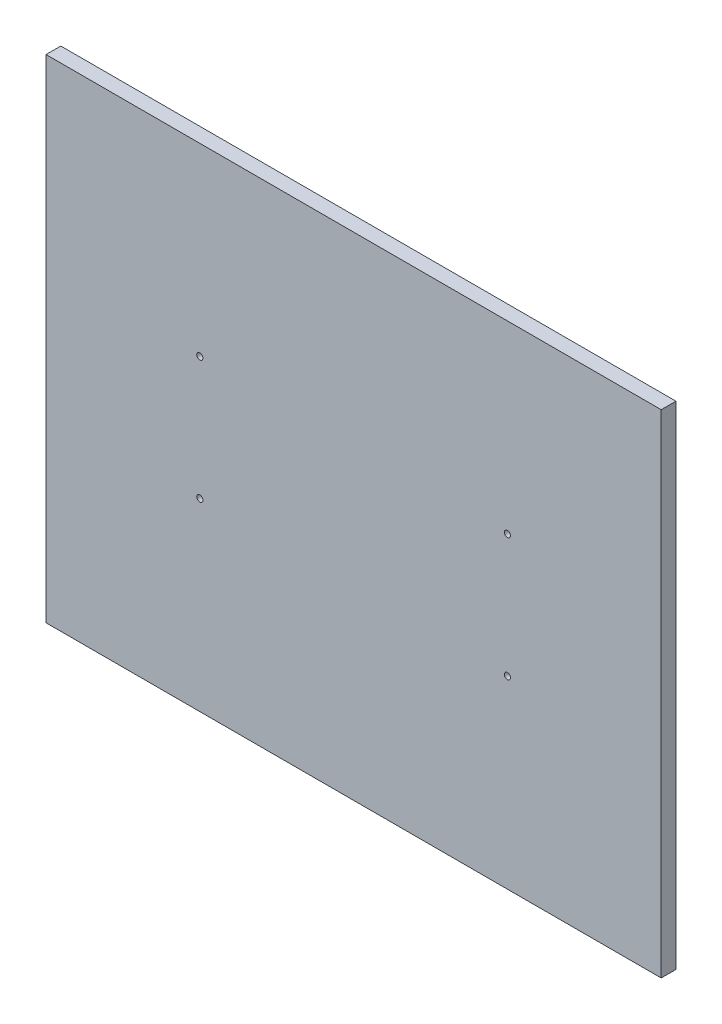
ISO-10303-21;
HEADER;
FILE_DESCRIPTION(('STEP AP214'),'2;1');
FILE_NAME('part.step','',(''),(''),'','','');
FILE_SCHEMA(('AUTOMOTIVE_DESIGN { 1 0 10303 214 1 1 1 1 }'));
ENDSEC;
DATA;
#1=APPLICATION_CONTEXT('core data for automotive mechanical design processes');
#2=APPLICATION_PROTOCOL_DEFINITION('international standard','automotive_design',2000,#1);
#3=PRODUCT_CONTEXT('',#1,'mechanical');
#4=PRODUCT('Part','Part','',(#3));
#5=PRODUCT_RELATED_PRODUCT_CATEGORY('part','',(#4));
#6=PRODUCT_DEFINITION_FORMATION('','',#4);
#7=PRODUCT_DEFINITION_CONTEXT('part definition',#1,'design');
#8=PRODUCT_DEFINITION('design','',#6,#7);
#9=PRODUCT_DEFINITION_SHAPE('','',#8);
#10=(LENGTH_UNIT() NAMED_UNIT(*) SI_UNIT(.MILLI.,.METRE.));
#11=(NAMED_UNIT(*) PLANE_ANGLE_UNIT() SI_UNIT($,.RADIAN.));
#12=(NAMED_UNIT(*) SI_UNIT($,.STERADIAN.) SOLID_ANGLE_UNIT());
#13=UNCERTAINTY_MEASURE_WITH_UNIT(LENGTH_MEASURE(1.E-05),#10,'distance_accuracy_value','');
#14=(GEOMETRIC_REPRESENTATION_CONTEXT(3) GLOBAL_UNCERTAINTY_ASSIGNED_CONTEXT((#13)) GLOBAL_UNIT_ASSIGNED_CONTEXT((#10,
#11,#12)) REPRESENTATION_CONTEXT('',''));
#15=CARTESIAN_POINT('',(0.,0.,0.));
#16=DIRECTION('',(0.,0.,1.));
#17=DIRECTION('',(1.,0.,0.));
#18=AXIS2_PLACEMENT_3D('',#15,#16,#17);
#19=CARTESIAN_POINT('',(0.,0.,6.));
#20=DIRECTION('',(0.,0.,-1.));
#21=DIRECTION('',(-1.,0.,0.));
#22=AXIS2_PLACEMENT_3D('',#19,#20,#21);
#23=PLANE('',#22);
#24=CARTESIAN_POINT('',(-62.5,-25.,6.));
#25=DIRECTION('',(0.,0.,1.));
#26=DIRECTION('',(-1.,0.,0.));
#27=AXIS2_PLACEMENT_3D('',#24,#25,#26);
#28=CIRCLE('',#27,1.25);
#29=CARTESIAN_POINT('',(-63.75,-25.,6.));
#30=VERTEX_POINT('',#29);
#31=EDGE_CURVE('E149',#30,#30,#28,.T.);
#32=ORIENTED_EDGE('',*,*,#31,.F.);
#33=EDGE_LOOP('',(#32));
#34=FACE_BOUND('',#33,.T.);
#35=CARTESIAN_POINT('',(-62.5,25.,6.));
#36=DIRECTION('',(0.,0.,-1.));
#37=DIRECTION('',(-1.,0.,0.));
#38=AXIS2_PLACEMENT_3D('',#35,#36,#37);
#39=CIRCLE('',#38,1.25);
#40=CARTESIAN_POINT('',(-63.75,25.,6.));
#41=VERTEX_POINT('',#40);
#42=EDGE_CURVE('E103',#41,#41,#39,.T.);
#43=ORIENTED_EDGE('',*,*,#42,.T.);
#44=EDGE_LOOP('',(#43));
#45=FACE_BOUND('',#44,.T.);
#46=DIRECTION('',(0.,1.,0.));
#47=VECTOR('',#46,1.);
#48=CARTESIAN_POINT('',(-125.,-100.,6.));
#49=LINE('',#48,#47);
#50=CARTESIAN_POINT('',(-125.,-100.,6.));
#51=VERTEX_POINT('',#50);
#52=CARTESIAN_POINT('',(-125.,100.,6.));
#53=VERTEX_POINT('',#52);
#54=EDGE_CURVE('E93',#51,#53,#49,.T.);
#55=ORIENTED_EDGE('',*,*,#54,.F.);
#56=DIRECTION('',(1.,0.,0.));
#57=VECTOR('',#56,1.);
#58=CARTESIAN_POINT('',(-125.,-100.,6.));
#59=LINE('',#58,#57);
#60=CARTESIAN_POINT('',(125.,-100.,6.));
#61=VERTEX_POINT('',#60);
#62=EDGE_CURVE('E83',#51,#61,#59,.T.);
#63=ORIENTED_EDGE('',*,*,#62,.T.);
#64=DIRECTION('',(0.,1.,0.));
#65=VECTOR('',#64,1.);
#66=CARTESIAN_POINT('',(125.,-100.,6.));
#67=LINE('',#66,#65);
#68=CARTESIAN_POINT('',(125.,100.,6.));
#69=VERTEX_POINT('',#68);
#70=EDGE_CURVE('E78',#61,#69,#67,.T.);
#71=ORIENTED_EDGE('',*,*,#70,.T.);
#72=DIRECTION('',(1.,0.,0.));
#73=VECTOR('',#72,1.);
#74=CARTESIAN_POINT('',(-125.,100.,6.));
#75=LINE('',#74,#73);
#76=EDGE_CURVE('E82',#53,#69,#75,.T.);
#77=ORIENTED_EDGE('',*,*,#76,.F.);
#78=EDGE_LOOP('',(#55,#63,#71,#77));
#79=FACE_BOUND('',#78,.T.);
#80=CARTESIAN_POINT('',(62.5,-25.,6.));
#81=DIRECTION('',(0.,0.,-1.));
#82=DIRECTION('',(1.,0.,0.));
#83=AXIS2_PLACEMENT_3D('',#80,#81,#82);
#84=CIRCLE('',#83,1.25);
#85=CARTESIAN_POINT('',(63.75,-25.,6.));
#86=VERTEX_POINT('',#85);
#87=EDGE_CURVE('E156',#86,#86,#84,.T.);
#88=ORIENTED_EDGE('',*,*,#87,.T.);
#89=EDGE_LOOP('',(#88));
#90=FACE_BOUND('',#89,.T.);
#91=CARTESIAN_POINT('',(62.5,25.,6.));
#92=DIRECTION('',(0.,0.,1.));
#93=DIRECTION('',(1.,0.,0.));
#94=AXIS2_PLACEMENT_3D('',#91,#92,#93);
#95=CIRCLE('',#94,1.25);
#96=CARTESIAN_POINT('',(63.75,25.,6.));
#97=VERTEX_POINT('',#96);
#98=EDGE_CURVE('E161',#97,#97,#95,.T.);
#99=ORIENTED_EDGE('',*,*,#98,.F.);
#100=EDGE_LOOP('',(#99));
#101=FACE_BOUND('',#100,.T.);
#102=ADVANCED_FACE('F32',(#34,#45,#79,#90,#101),#23,.F.);
#103=CARTESIAN_POINT('',(0.,0.,0.));
#104=DIRECTION('',(0.,0.,-1.));
#105=DIRECTION('',(-1.,0.,0.));
#106=AXIS2_PLACEMENT_3D('',#103,#104,#105);
#107=PLANE('',#106);
#108=CARTESIAN_POINT('',(-62.5,-25.,0.));
#109=DIRECTION('',(0.,0.,1.));
#110=DIRECTION('',(-1.,0.,0.));
#111=AXIS2_PLACEMENT_3D('',#108,#109,#110);
#112=CIRCLE('',#111,1.25);
#113=CARTESIAN_POINT('',(-63.75,-25.,0.));
#114=VERTEX_POINT('',#113);
#115=EDGE_CURVE('E152',#114,#114,#112,.T.);
#116=ORIENTED_EDGE('',*,*,#115,.T.);
#117=EDGE_LOOP('',(#116));
#118=FACE_BOUND('',#117,.T.);
#119=CARTESIAN_POINT('',(-62.5,25.,0.));
#120=DIRECTION('',(0.,0.,-1.));
#121=DIRECTION('',(-1.,0.,0.));
#122=AXIS2_PLACEMENT_3D('',#119,#120,#121);
#123=CIRCLE('',#122,1.25);
#124=CARTESIAN_POINT('',(-63.75,25.,0.));
#125=VERTEX_POINT('',#124);
#126=EDGE_CURVE('E147',#125,#125,#123,.T.);
#127=ORIENTED_EDGE('',*,*,#126,.F.);
#128=EDGE_LOOP('',(#127));
#129=FACE_BOUND('',#128,.T.);
#130=DIRECTION('',(0.,1.,0.));
#131=VECTOR('',#130,1.);
#132=CARTESIAN_POINT('',(-125.,-100.,0.));
#133=LINE('',#132,#131);
#134=CARTESIAN_POINT('',(-125.,-100.,0.));
#135=VERTEX_POINT('',#134);
#136=CARTESIAN_POINT('',(-125.,100.,0.));
#137=VERTEX_POINT('',#136);
#138=EDGE_CURVE('E99',#135,#137,#133,.T.);
#139=ORIENTED_EDGE('',*,*,#138,.T.);
#140=DIRECTION('',(1.,0.,0.));
#141=VECTOR('',#140,1.);
#142=CARTESIAN_POINT('',(-125.,100.,0.));
#143=LINE('',#142,#141);
#144=CARTESIAN_POINT('',(125.,100.,0.));
#145=VERTEX_POINT('',#144);
#146=EDGE_CURVE('E102',#137,#145,#143,.T.);
#147=ORIENTED_EDGE('',*,*,#146,.T.);
#148=DIRECTION('',(0.,1.,0.));
#149=VECTOR('',#148,1.);
#150=CARTESIAN_POINT('',(125.,-100.,0.));
#151=LINE('',#150,#149);
#152=CARTESIAN_POINT('',(125.,-100.,0.));
#153=VERTEX_POINT('',#152);
#154=EDGE_CURVE('E90',#153,#145,#151,.T.);
#155=ORIENTED_EDGE('',*,*,#154,.F.);
#156=DIRECTION('',(1.,0.,0.));
#157=VECTOR('',#156,1.);
#158=CARTESIAN_POINT('',(-125.,-100.,0.));
#159=LINE('',#158,#157);
#160=EDGE_CURVE('E66',#135,#153,#159,.T.);
#161=ORIENTED_EDGE('',*,*,#160,.F.);
#162=EDGE_LOOP('',(#139,#147,#155,#161));
#163=FACE_BOUND('',#162,.T.);
#164=CARTESIAN_POINT('',(62.5,-25.,0.));
#165=DIRECTION('',(0.,0.,-1.));
#166=DIRECTION('',(1.,0.,0.));
#167=AXIS2_PLACEMENT_3D('',#164,#165,#166);
#168=CIRCLE('',#167,1.25);
#169=CARTESIAN_POINT('',(63.75,-25.,0.));
#170=VERTEX_POINT('',#169);
#171=EDGE_CURVE('E158',#170,#170,#168,.T.);
#172=ORIENTED_EDGE('',*,*,#171,.F.);
#173=EDGE_LOOP('',(#172));
#174=FACE_BOUND('',#173,.T.);
#175=CARTESIAN_POINT('',(62.5,25.,0.));
#176=DIRECTION('',(0.,0.,1.));
#177=DIRECTION('',(1.,0.,0.));
#178=AXIS2_PLACEMENT_3D('',#175,#176,#177);
#179=CIRCLE('',#178,1.25);
#180=CARTESIAN_POINT('',(63.75,25.,0.));
#181=VERTEX_POINT('',#180);
#182=EDGE_CURVE('E164',#181,#181,#179,.T.);
#183=ORIENTED_EDGE('',*,*,#182,.T.);
#184=EDGE_LOOP('',(#183));
#185=FACE_BOUND('',#184,.T.);
#186=ADVANCED_FACE('F108',(#118,#129,#163,#174,#185),#107,.T.);
#187=CARTESIAN_POINT('',(-125.,-100.,6.));
#188=DIRECTION('',(-1.,0.,0.));
#189=DIRECTION('',(0.,0.,1.));
#190=AXIS2_PLACEMENT_3D('',#187,#188,#189);
#191=PLANE('',#190);
#192=ORIENTED_EDGE('',*,*,#138,.F.);
#193=DIRECTION('',(0.,0.,-1.));
#194=VECTOR('',#193,1.);
#195=CARTESIAN_POINT('',(-125.,-100.,6.));
#196=LINE('',#195,#194);
#197=EDGE_CURVE('E11',#51,#135,#196,.T.);
#198=ORIENTED_EDGE('',*,*,#197,.F.);
#199=ORIENTED_EDGE('',*,*,#54,.T.);
#200=DIRECTION('',(0.,0.,-1.));
#201=VECTOR('',#200,1.);
#202=CARTESIAN_POINT('',(-125.,100.,6.));
#203=LINE('',#202,#201);
#204=EDGE_CURVE('E36',#53,#137,#203,.T.);
#205=ORIENTED_EDGE('',*,*,#204,.T.);
#206=EDGE_LOOP('',(#192,#198,#199,#205));
#207=FACE_BOUND('',#206,.T.);
#208=ADVANCED_FACE('F34',(#207),#191,.T.);
#209=CARTESIAN_POINT('',(-125.,-100.,6.));
#210=DIRECTION('',(0.,1.,0.));
#211=DIRECTION('',(0.,0.,1.));
#212=AXIS2_PLACEMENT_3D('',#209,#210,#211);
#213=PLANE('',#212);
#214=ORIENTED_EDGE('',*,*,#160,.T.);
#215=DIRECTION('',(0.,0.,-1.));
#216=VECTOR('',#215,1.);
#217=CARTESIAN_POINT('',(125.,-100.,6.));
#218=LINE('',#217,#216);
#219=EDGE_CURVE('E42',#61,#153,#218,.T.);
#220=ORIENTED_EDGE('',*,*,#219,.F.);
#221=ORIENTED_EDGE('',*,*,#62,.F.);
#222=ORIENTED_EDGE('',*,*,#197,.T.);
#223=EDGE_LOOP('',(#214,#220,#221,#222));
#224=FACE_BOUND('',#223,.T.);
#225=ADVANCED_FACE('F111',(#224),#213,.F.);
#226=CARTESIAN_POINT('',(125.,-100.,6.));
#227=DIRECTION('',(-1.,0.,0.));
#228=DIRECTION('',(0.,0.,1.));
#229=AXIS2_PLACEMENT_3D('',#226,#227,#228);
#230=PLANE('',#229);
#231=ORIENTED_EDGE('',*,*,#154,.T.);
#232=DIRECTION('',(0.,0.,-1.));
#233=VECTOR('',#232,1.);
#234=CARTESIAN_POINT('',(125.,100.,6.));
#235=LINE('',#234,#233);
#236=EDGE_CURVE('E87',#69,#145,#235,.T.);
#237=ORIENTED_EDGE('',*,*,#236,.F.);
#238=ORIENTED_EDGE('',*,*,#70,.F.);
#239=ORIENTED_EDGE('',*,*,#219,.T.);
#240=EDGE_LOOP('',(#231,#237,#238,#239));
#241=FACE_BOUND('',#240,.T.);
#242=ADVANCED_FACE('F88',(#241),#230,.F.);
#243=CARTESIAN_POINT('',(-125.,100.,6.));
#244=DIRECTION('',(0.,1.,0.));
#245=DIRECTION('',(0.,0.,1.));
#246=AXIS2_PLACEMENT_3D('',#243,#244,#245);
#247=PLANE('',#246);
#248=ORIENTED_EDGE('',*,*,#146,.F.);
#249=ORIENTED_EDGE('',*,*,#204,.F.);
#250=ORIENTED_EDGE('',*,*,#76,.T.);
#251=ORIENTED_EDGE('',*,*,#236,.T.);
#252=EDGE_LOOP('',(#248,#249,#250,#251));
#253=FACE_BOUND('',#252,.T.);
#254=ADVANCED_FACE('F92',(#253),#247,.T.);
#255=CARTESIAN_POINT('',(-62.5,25.,6.));
#256=DIRECTION('',(0.,0.,-1.));
#257=DIRECTION('',(-1.,0.,0.));
#258=AXIS2_PLACEMENT_3D('',#255,#256,#257);
#259=CYLINDRICAL_SURFACE('',#258,1.25);
#260=ORIENTED_EDGE('',*,*,#42,.F.);
#261=EDGE_LOOP('',(#260));
#262=FACE_BOUND('',#261,.T.);
#263=ORIENTED_EDGE('',*,*,#126,.T.);
#264=EDGE_LOOP('',(#263));
#265=FACE_BOUND('',#264,.T.);
#266=ADVANCED_FACE('F127',(#262,#265),#259,.F.);
#267=CARTESIAN_POINT('',(-62.5,-25.,6.));
#268=DIRECTION('',(0.,0.,-1.));
#269=DIRECTION('',(-1.,0.,0.));
#270=AXIS2_PLACEMENT_3D('',#267,#268,#269);
#271=CYLINDRICAL_SURFACE('',#270,1.25);
#272=ORIENTED_EDGE('',*,*,#31,.T.);
#273=EDGE_LOOP('',(#272));
#274=FACE_BOUND('',#273,.T.);
#275=ORIENTED_EDGE('',*,*,#115,.F.);
#276=EDGE_LOOP('',(#275));
#277=FACE_BOUND('',#276,.T.);
#278=ADVANCED_FACE('F135',(#274,#277),#271,.F.);
#279=CARTESIAN_POINT('',(62.5,-25.,6.));
#280=DIRECTION('',(0.,0.,-1.));
#281=DIRECTION('',(-1.,0.,0.));
#282=AXIS2_PLACEMENT_3D('',#279,#280,#281);
#283=CYLINDRICAL_SURFACE('',#282,1.25);
#284=ORIENTED_EDGE('',*,*,#87,.F.);
#285=EDGE_LOOP('',(#284));
#286=FACE_BOUND('',#285,.T.);
#287=ORIENTED_EDGE('',*,*,#171,.T.);
#288=EDGE_LOOP('',(#287));
#289=FACE_BOUND('',#288,.T.);
#290=ADVANCED_FACE('F140',(#286,#289),#283,.F.);
#291=CARTESIAN_POINT('',(62.5,25.,6.));
#292=DIRECTION('',(0.,0.,-1.));
#293=DIRECTION('',(-1.,0.,0.));
#294=AXIS2_PLACEMENT_3D('',#291,#292,#293);
#295=CYLINDRICAL_SURFACE('',#294,1.25);
#296=ORIENTED_EDGE('',*,*,#98,.T.);
#297=EDGE_LOOP('',(#296));
#298=FACE_BOUND('',#297,.T.);
#299=ORIENTED_EDGE('',*,*,#182,.F.);
#300=EDGE_LOOP('',(#299));
#301=FACE_BOUND('',#300,.T.);
#302=ADVANCED_FACE('F170',(#298,#301),#295,.F.);
#303=CLOSED_SHELL('',(#102,#186,#208,#225,#242,#254,#266,#278,#290,#302));
#304=MANIFOLD_SOLID_BREP('B2',#303);
#305=ADVANCED_BREP_SHAPE_REPRESENTATION('',(#18,#304),#14);
#306=SHAPE_DEFINITION_REPRESENTATION(#9,#305);
ENDSEC;
END-ISO-10303-21;
